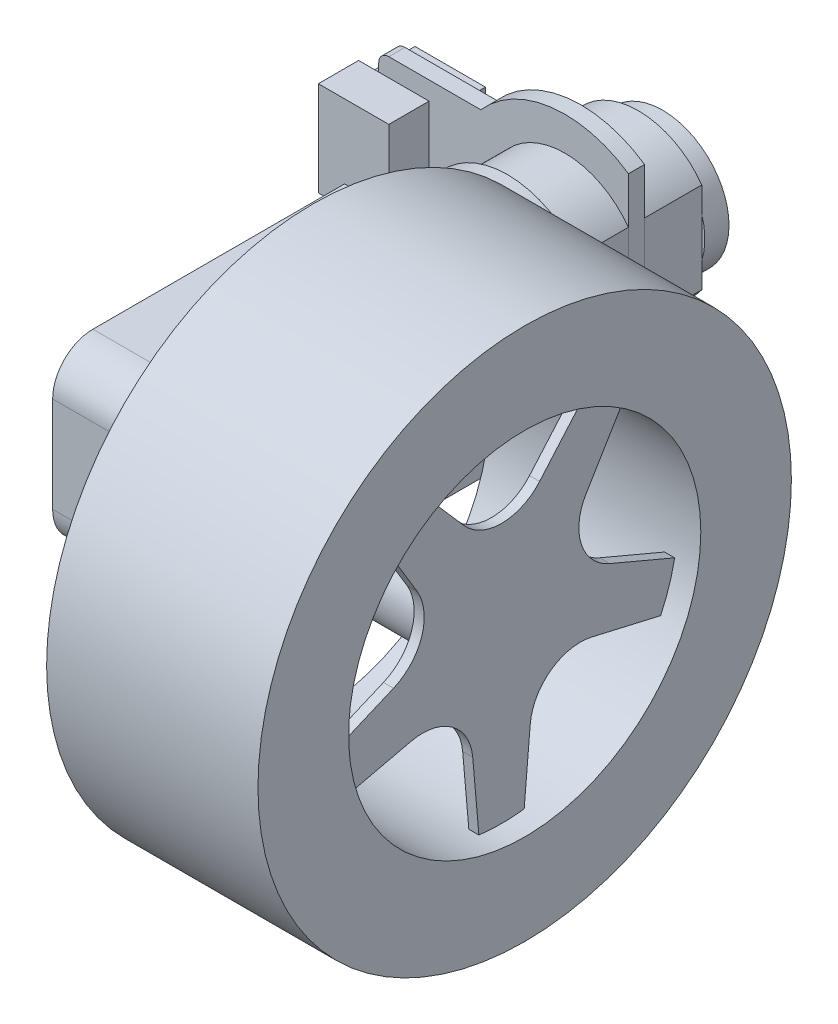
from build123d import *

# Parameters (mm, degrees)
SKETCH2_R            = 33.655
SKETCH2_R_2          = 22.225
BOSS_EXTRUDE1_DEPTH  = 26.67
BOSS_EXTRUDE2_DEPTH  = 1.27
SKETCH4_R            = 5.715
BOSS_EXTRUDE3_DEPTH  = 26.67
SKETCH5_R            = 1.397
BOSS_EXTRUDE4_DEPTH  = 18.542
BOSS_EXTRUDE5_DEPTH  = 11.303
BOSS_EXTRUDE6_DEPTH  = 16.51
SKETCH9_R            = 8.382
BOSS_EXTRUDE7_DEPTH  = 3.048
BOSS_EXTRUDE8_DEPTH  = 2.032
SKETCH11_W           = 8.89
SKETCH11_H           = 11.938
BOSS_EXTRUDE9_DEPTH  = 5.08
SKETCH12_W           = 8.89
SKETCH12_H           = 7.874
BOSS_EXTRUDE10_DEPTH = 5.08


with BuildPart() as part:
    # Sketch2 → Boss-Extrude1 (new body)
    with BuildSketch(Plane(origin=(0, 0, 0), x_dir=(0, 0, -1), z_dir=(1, 0, 0))):
        Circle(SKETCH2_R)
        Circle(SKETCH2_R_2, mode=Mode.SUBTRACT)
    extrude(amount=BOSS_EXTRUDE1_DEPTH)

    # Sketch3 → Boss-Extrude2 (add)
    with BuildSketch(Plane(origin=(23.749, 0, 0), x_dir=(0, 0, -1), z_dir=(1, 0, 0))):
        with BuildLine():
            Line((0, -29.776214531), (2.8575, -22.040538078))
            Line((2.8575, -22.040538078), (3.625182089, -13.158582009))
            ThreePointArc((3.625182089, -13.158582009), (6.217066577, -8.569647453), (11.381484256, -7.518469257))
            Line((11.381484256, -7.518469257), (20.0787813, -9.528544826))
            Line((20.0787813, -9.528544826), (28.31886286, -9.201356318))
            Line((28.31886286, -9.201356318), (21.844813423, -4.093256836))
            Line((21.844813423, -4.093256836), (13.634798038, -0.618472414))
            ThreePointArc((13.634798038, -0.618472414), (10.07139828, 3.264614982), (10.667561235, 8.501099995))
            Line((10.667561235, 8.501099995), (15.266869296, 16.151573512))
            Line((15.266869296, 16.151573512), (17.50201977, 24.089463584))
            Line((17.50201977, 24.089463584), (10.643337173, 19.510766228))
            Line((10.643337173, 19.510766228), (4.801586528, 12.776345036))
            ThreePointArc((4.801586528, 12.776345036), (0.007399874, 10.587290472), (-4.788568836, 12.772437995))
            Line((-4.788568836, 12.772437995), (-10.643337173, 19.510766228))
            Line((-10.643337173, 19.510766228), (-17.50201977, 24.089463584))
            Line((-17.50201977, 24.089463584), (-15.266869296, 16.151573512))
            Line((-15.266869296, 16.151573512), (-10.667254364, 8.514687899))
            ThreePointArc((-10.667254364, 8.514687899), (-10.066824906, 3.278690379), (-13.627059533, -0.607299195))
            Line((-13.627059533, -0.607299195), (-21.844813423, -4.093256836))
            Line((-21.844813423, -4.093256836), (-28.31886286, -9.201356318))
            Line((-28.31886286, -9.201356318), (-20.0787813, -9.528544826))
            Line((-20.0787813, -9.528544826), (-11.394312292, -7.513978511))
            ThreePointArc((-11.394312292, -7.513978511), (-6.229039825, -8.560948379), (-3.633417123, -13.147769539))
            Line((-3.633417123, -13.147769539), (-2.8575, -22.040538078))
            Line((-2.8575, -22.040538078), (0, -29.776214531))
        make_face()
    extrude(amount=-BOSS_EXTRUDE2_DEPTH)

    # Sketch4 → Boss-Extrude3 (add)
    with BuildSketch(Plane.ZY.offset(-22.479)):
        Circle(SKETCH4_R)
    extrude(amount=BOSS_EXTRUDE3_DEPTH)

    # Sketch5 → Boss-Extrude4 (add)
    with BuildSketch(Plane.ZY.offset(4.191)):
        with BuildLine():
            Line((5.08, 11.1125), (-26.67, 11.1125))
            Line((-26.67, 11.1125), (-26.67, -11.1125))
            Line((-26.67, -11.1125), (5.08, -11.1125))
            ThreePointArc((5.08, -11.1125), (8.672102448, -9.624602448), (10.16, -6.0325))
            Line((10.16, -6.0325), (10.16, 6.0325))
            ThreePointArc((10.16, 6.0325), (8.672102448, 9.624602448), (5.08, 11.1125))
        make_face()
        with Locations((-21.971, -8.8265)):
            Circle(SKETCH5_R, mode=Mode.SUBTRACT)
        with Locations((-21.971, 8.8265)):
            Circle(SKETCH5_R, mode=Mode.SUBTRACT)
    extrude(amount=BOSS_EXTRUDE4_DEPTH)

    # Sketch6 → Boss-Extrude5 (add)
    with BuildSketch(Plane(origin=(0, 0, -26.67), x_dir=(-1, 0, 0), z_dir=(0, 0, -1))):
        with BuildLine():
            Line((22.733, 6.126680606), (22.733, -6.126680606))
            ThreePointArc((22.733, -6.126680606), (13.462, -11.1125), (4.191, -6.126680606))
            Line((4.191, -6.126680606), (4.191, 6.126680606))
            ThreePointArc((4.191, 6.126680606), (13.462, 11.1125), (22.733, 6.126680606))
        make_face()
    extrude(amount=BOSS_EXTRUDE5_DEPTH)

    # Sketch8 → Boss-Extrude6 (add)
    with BuildSketch(Plane(origin=(0, 0, -37.973), x_dir=(-1, 0, 0), z_dir=(0, 0, -1))):
        with BuildLine():
            Line((21.463, -5.732260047), (21.463, 5.732260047))
            ThreePointArc((21.463, 5.732260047), (13.462, 9.8425), (5.461, 5.732260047))
            Line((5.461, 5.732260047), (5.461, -5.732260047))
            ThreePointArc((5.461, -5.732260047), (13.462, -9.8425), (21.463, -5.732260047))
        make_face()
    extrude(amount=BOSS_EXTRUDE6_DEPTH)

    # Sketch9 → Boss-Extrude7 (add)
    with BuildSketch(Plane(origin=(0, 0, -54.483), x_dir=(-1, 0, 0), z_dir=(0, 0, -1))):
        with Locations(Location((13.462, 0, 0), (0, 0, 342.658557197))):
            Circle(SKETCH9_R)
    extrude(amount=BOSS_EXTRUDE7_DEPTH)

    # Sketch10 → Boss-Extrude8 (add)
    with BuildSketch(Plane(origin=(0, 0, -47.244), x_dir=(-1, 0, 0), z_dir=(0, 0, -1))):
        with BuildLine():
            Line((5.446875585, -11.596688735), (5.446875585, 11.596688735))
            ThreePointArc((5.446875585, 11.596688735), (15.207826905, 13.988477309), (24.08150884, 9.271))
            Line((24.08150884, 9.271), (35.687, 9.271))
            ThreePointArc((35.687, 9.271), (36.585025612, 8.899025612), (36.957, 8.001))
            Line((36.957, 8.001), (36.957, -8.001))
            ThreePointArc((36.957, -8.001), (36.585025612, -8.899025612), (35.687, -9.271))
            Line((35.687, -9.271), (24.08150884, -9.271))
            ThreePointArc((24.08150884, -9.271), (15.207826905, -13.988477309), (5.446875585, -11.596688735))
        make_face()
    extrude(amount=-BOSS_EXTRUDE8_DEPTH)

    # Sketch11 → Boss-Extrude9 (add)
    with BuildSketch(Plane.XY.offset(-45.212)):
        with Locations((-35.052, 0.982477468)):
            Rectangle(SKETCH11_W, SKETCH11_H)
    extrude(amount=BOSS_EXTRUDE9_DEPTH)

    # Sketch12 → Boss-Extrude10 (add)
    with BuildSketch(Plane(origin=(0, 0, -47.244), x_dir=(-1, 0, 0), z_dir=(0, 0, -1))):
        with Locations((35.052, 0.992156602)):
            Rectangle(SKETCH12_W, SKETCH12_H)
    extrude(amount=BOSS_EXTRUDE10_DEPTH)


solid = part.part
